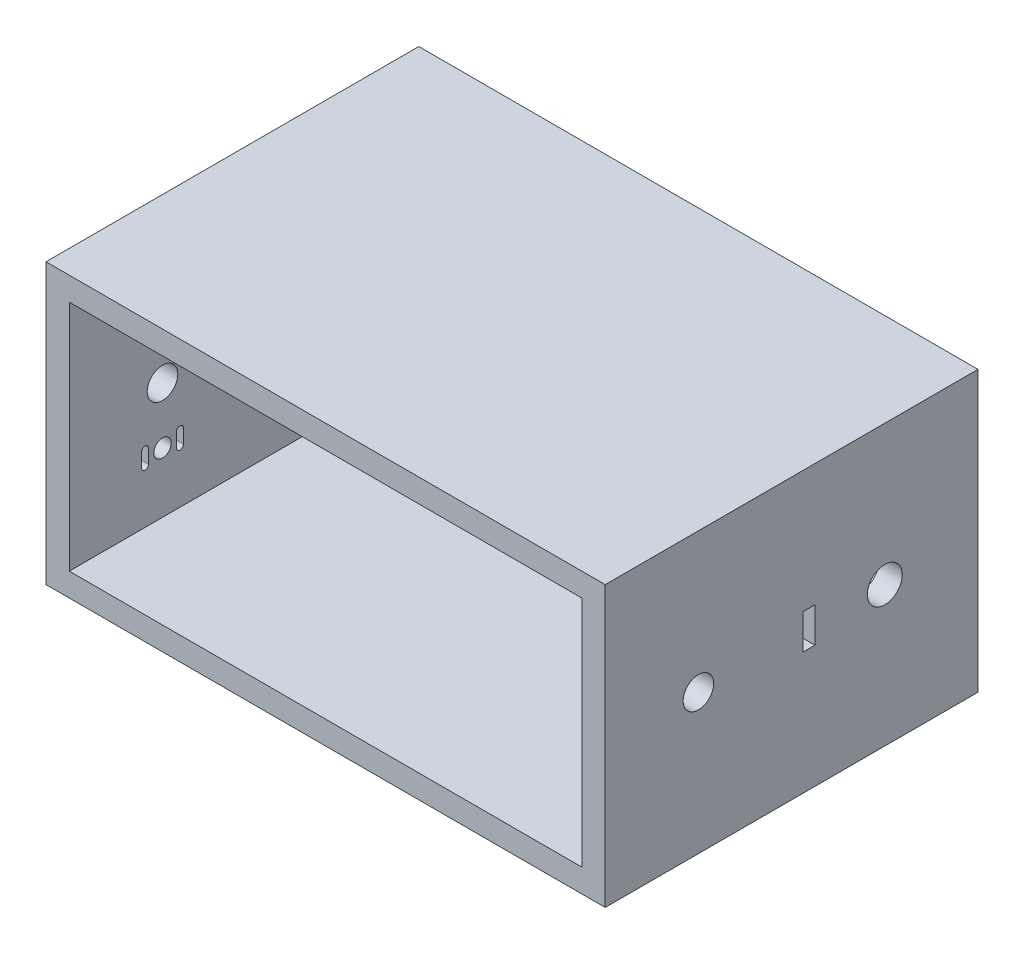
from build123d import *

# Parameters (mm, degrees)
SKETCH1_W                        = 304.8
SKETCH1_H                        = 152.4
SKETCH1_W_2                      = 279.4
SKETCH1_H_2                      = 127
BOSS_EXTRUDE1_DEPTH              = 203.2
F_3_4_10_TAPPED_HOLE1_D          = 16.66748
CUT_EXTRUDE1_REACH               = 389.384
SKETCH11_R                       = 4.7625
SKETCH15_W                       = 6.35
SKETCH15_H                       = 19.05
CUT_EXTRUDE2_DEPTH               = 388.383551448
F_97_0_0059_DIAMETER_HOLE3_D     = 19.05
F_97_0_0059_DIAMETER_HOLE3_DEPTH = 304.8
F_97_0_0059_DIAMETER_HOLE3_TIP   = 5.723197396


with BuildPart() as part:
    # Sketch1 → Boss-Extrude1 (new body)
    with BuildSketch(Plane.XY):
        with Locations((115.691880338, 49.787046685)):
            Rectangle(SKETCH1_W, SKETCH1_H)
        with Locations((115.691880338, 49.787046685)):
            Rectangle(SKETCH1_W_2, SKETCH1_H_2, mode=Mode.SUBTRACT)
    extrude(amount=BOSS_EXTRUDE1_DEPTH)

    # 3_4-10 Tapped Hole1 (through all)
    with Locations(Plane(origin=(268.091880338, 0, 0), x_dir=(0, 0, -1), z_dir=(1, 0, 0))):
        with Locations((-152.4, 49.787046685)):
            Hole(F_3_4_10_TAPPED_HOLE1_D / 2)

    # Sketch11 → Cut-Extrude1 (cut, up to next)
    with BuildSketch(Plane.ZY.offset(36.708119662), mode=Mode.PRIVATE) as cut_extrude1_sk1:
        with Locations(Location((152.4, 19.05, 0), (0, 0, 270))):
            Circle(SKETCH11_R)
    cut_extrude1_tool1 = extrude(cut_extrude1_sk1.sketch, amount=-CUT_EXTRUDE1_REACH, mode=Mode.PRIVATE) & part.part
    # Sketch11 → Cut-Extrude1 (cut, up to next)
    with BuildSketch(Plane.ZY.offset(36.708119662), mode=Mode.PRIVATE) as cut_extrude1_sk2:
        with BuildLine():
            Line((144.78, 22.86), (144.78, 15.24))
            ThreePointArc((144.78, 15.24), (142.875, 13.335), (140.97, 15.24))
            Line((140.97, 15.24), (140.97, 22.86))
            ThreePointArc((140.97, 22.86), (142.875, 24.765), (144.78, 22.86))
        make_face()
    cut_extrude1_tool2 = extrude(cut_extrude1_sk2.sketch, amount=-CUT_EXTRUDE1_REACH, mode=Mode.PRIVATE) & part.part
    # Sketch11 → Cut-Extrude1 (cut, up to next)
    with BuildSketch(Plane.ZY.offset(36.708119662), mode=Mode.PRIVATE) as cut_extrude1_sk3:
        with BuildLine():
            Line((160.02, 22.86), (160.02, 15.24))
            ThreePointArc((160.02, 15.24), (161.925, 13.335), (163.83, 15.24))
            Line((163.83, 15.24), (163.83, 22.86))
            ThreePointArc((163.83, 22.86), (161.925, 24.765), (160.02, 22.86))
        make_face()
    cut_extrude1_tool3 = extrude(cut_extrude1_sk3.sketch, amount=-CUT_EXTRUDE1_REACH, mode=Mode.PRIVATE) & part.part
    add(cut_extrude1_tool1.solids().sort_by_distance((-36.70812, 19.05, 152.4))[0], mode=Mode.SUBTRACT)
    add(cut_extrude1_tool2.solids().sort_by_distance((-36.70812, 19.05, 142.875))[0], mode=Mode.SUBTRACT)
    add(cut_extrude1_tool3.solids().sort_by_distance((-36.70812, 19.05, 161.925))[0], mode=Mode.SUBTRACT)

    # Sketch15 → Cut-Extrude2 (cut, through all)
    with BuildSketch(Plane.ZY.offset(36.708119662)):
        with Locations((92.075, 49.787046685)):
            Rectangle(SKETCH15_W, SKETCH15_H)
    extrude(amount=-CUT_EXTRUDE2_DEPTH, mode=Mode.SUBTRACT)

    # 97 _0.0059_ Diameter Hole3
    with Locations(Plane.ZY.offset(36.708119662)):
        with Locations((50.8, 49.787046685)):
            Hole(F_97_0_0059_DIAMETER_HOLE3_D / 2, depth=F_97_0_0059_DIAMETER_HOLE3_DEPTH)
            with Locations((0, 0, -(F_97_0_0059_DIAMETER_HOLE3_DEPTH + F_97_0_0059_DIAMETER_HOLE3_TIP / 2))):  # 118° drill point
                Cone(0, F_97_0_0059_DIAMETER_HOLE3_D / 2, F_97_0_0059_DIAMETER_HOLE3_TIP, mode=Mode.SUBTRACT)


solid = part.part
